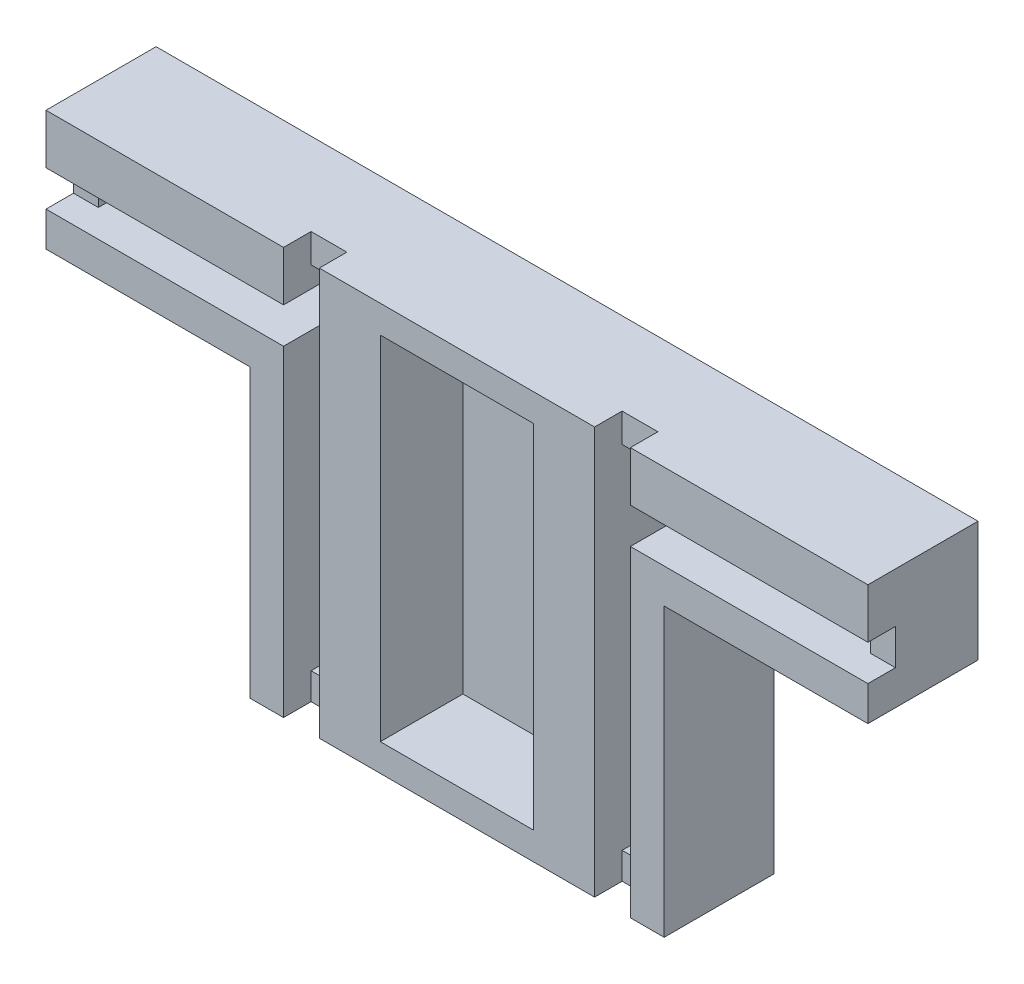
from build123d import *

# Parameters (mm, degrees)
SKETCH1_W           = 149.3
SKETCH1_H           = 73.97
BOSS_EXTRUDE1_DEPTH = 20
SKETCH2_W           = 27.840642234
SKETCH2_H           = 63.97
CUT_EXTRUDE1_DEPTH  = 15
SKETCH3_W           = 37.014569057
SKETCH3_H           = 52.121187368
CUT_EXTRUDE2_DEPTH  = 20
SKETCH6_W           = 4.5
SKETCH6_H           = 6.5
SKETCH6_W_2         = 6.5
SKETCH6_H_2         = 4.87
SKETCH6_H_3         = 5.25
CUT_EXTRUDE3_DEPTH  = 5


with BuildPart() as part:
    # Sketch1 → Boss-Extrude1 (new body)
    with BuildSketch(Plane.XY):
        with Locations((74.65, 36.985)):
            Rectangle(SKETCH1_W, SKETCH1_H)
    extrude(amount=BOSS_EXTRUDE1_DEPTH)

    # Sketch2 → Cut-Extrude1 (cut)
    with BuildSketch(Plane.XY.offset(20)):
        Polygon((4.5, 64.92), (4.5, 58.42), (43.15, 58.42), (43.15, 4.87), (49.65, 4.87), (49.65, 68.72), (43.15, 68.72), (43.15, 64.92), align=None)
        Polygon((106.15, 68.72), (99.65, 68.72), (99.65, 4.87), (106.15, 4.87), (106.15, 58.42), (144.8, 58.42), (144.8, 64.92), (106.15, 64.92), align=None)
        with Locations((74.65, 36.985)):
            Rectangle(SKETCH2_W, SKETCH2_H)
    extrude(amount=-CUT_EXTRUDE1_DEPTH, mode=Mode.SUBTRACT)

    # Sketch3 → Cut-Extrude2 (cut)
    with BuildSketch(Plane.XY.offset(20)):
        with Locations((18.507284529, 26.060593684)):
            Rectangle(SKETCH3_W, SKETCH3_H)
        with Locations((130.792715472, 26.060593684)):
            Rectangle(SKETCH3_W, SKETCH3_H)
    extrude(amount=-CUT_EXTRUDE2_DEPTH, mode=Mode.SUBTRACT)

    # Sketch6 → Cut-Extrude3 (cut)
    with BuildSketch(Plane.XY.offset(20)):
        with Locations((147.05, 61.67)):
            Rectangle(SKETCH6_W, SKETCH6_H)
        with Locations((102.9, 2.435)):
            Rectangle(SKETCH6_W_2, SKETCH6_H_2)
        with Locations((46.4, 2.435)):
            Rectangle(SKETCH6_W_2, SKETCH6_H_2)
        with Locations((2.25, 61.67)):
            Rectangle(SKETCH6_W, SKETCH6_H)
        with Locations((46.4, 71.345)):
            Rectangle(SKETCH6_W_2, SKETCH6_H_3)
        with Locations((102.9, 71.345)):
            Rectangle(SKETCH6_W_2, SKETCH6_H_3)
    extrude(amount=-CUT_EXTRUDE3_DEPTH, mode=Mode.SUBTRACT)


solid = part.part
